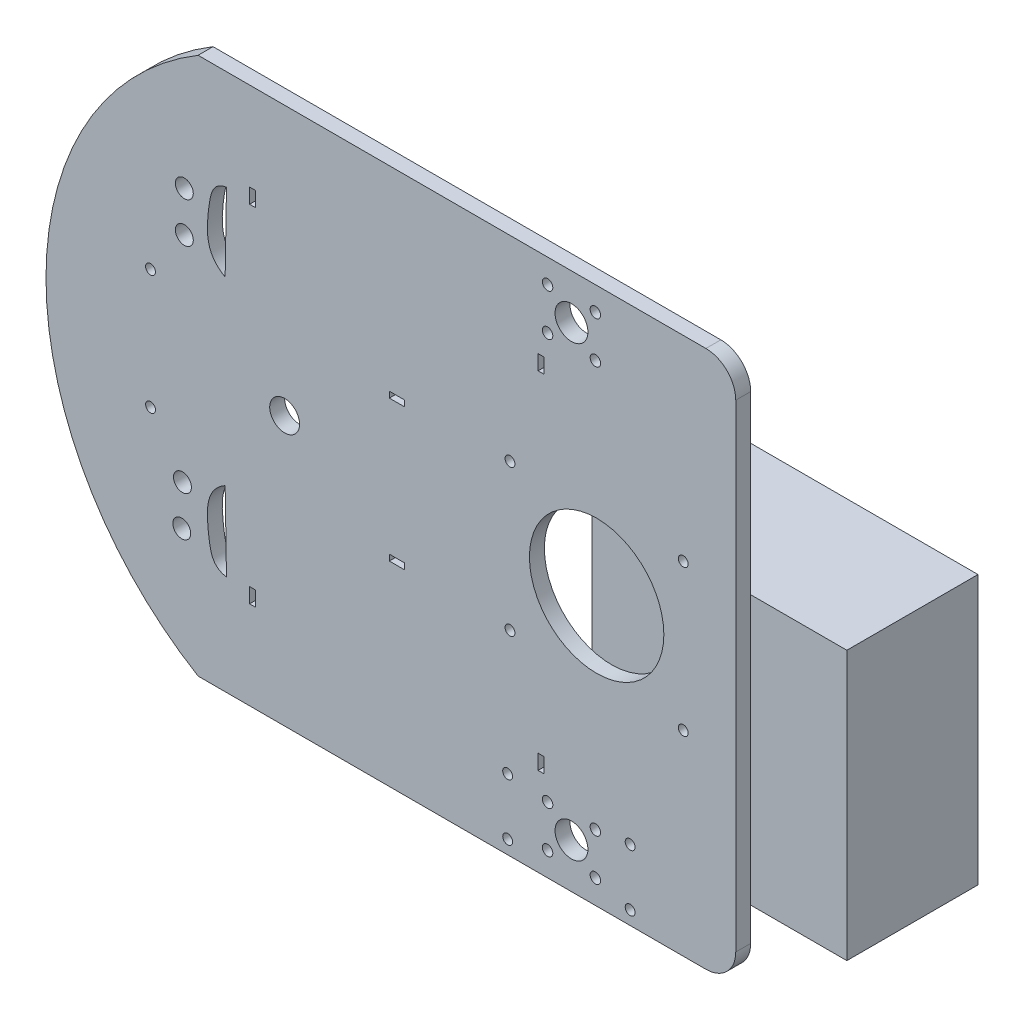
from build123d import *

# Parameters (mm, degrees)
EXTRUDE_1_DEPTH      = 5
SKETCH_6_R           = 1.65
CUT_EXTRUDE_2_DEPTH  = 293.826803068
SKETCH_7_R           = 1.75
SKETCH_7_R_2         = 5.5
CUT_EXTRUDE_3_DEPTH  = 10
SKETCH_11_R          = 1.65
CUT_EXTRUDE_4_DEPTH  = 293.826803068
SKETCH_17_W          = 2
SKETCH_17_H          = 5
CUT_EXTRUDE_9_DEPTH  = 293.826803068
SKETCH_20_W          = 2
SKETCH_20_H          = 5
CUT_EXTRUDE_10_DEPTH = 293.826803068
SKETCH_27_W          = 5
SKETCH_27_H          = 2
CUT_EXTRUDE_14_DEPTH = 293.826803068
SKETCH_29_W          = 85.279884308
SKETCH_29_H          = 43.905996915
EXTRUDE_2_DEPTH      = 90
SKETCH_32_R          = 3
CUT_EXTRUDE_15_DEPTH = 10
SKETCH_35_R          = 5
CUT_EXTRUDE_16_DEPTH = 10
CUT_EXTRUDE_17_DEPTH = 10
CUT_EXTRUDE_19_DEPTH = 10
SKETCH_40_R          = 1.65
CUT_EXTRUDE_20_DEPTH = 10


with BuildPart() as part:
    # Sketch 1 → Extrude 1 (new body)
    with BuildSketch(Plane.XY):
        with BuildLine():
            Line((-10, 0), (-180, 0))
            ThreePointArc((-180, 0), (-230.916730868, 90), (-180, 180))
            Line((-180, 180), (-10, 180))
            ThreePointArc((-10, 180), (-2.928932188, 177.071067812), (0, 170))
            Line((0, 170), (0, 10))
            ThreePointArc((0, 10), (-2.928932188, 2.928932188), (-10, 0))
        make_face()
    extrude(amount=EXTRUDE_1_DEPTH)

    # Sketch 6 → Cut-Extrude 2 (cut, through all)
    with BuildSketch(Plane.XY.offset(5)):
        with Locations((-195.916730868, 110)):
            Circle(SKETCH_6_R)
        with Locations(Location((-195.916730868, 70, 0), (0, 0, 180))):
            Circle(SKETCH_6_R)
    extrude(amount=-CUT_EXTRUDE_2_DEPTH, mode=Mode.SUBTRACT)

    # Sketch 7 → Cut-Extrude 3 (cut)
    with BuildSketch(Plane(origin=(0, 0, 0), x_dir=(-1, 0, 0), z_dir=(0, 0, -1))):
        with Locations((47.000000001, 157.999999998)):
            Circle(SKETCH_7_R)
        with Locations((46.999999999, 171.999999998)):
            Circle(SKETCH_7_R)
        with Locations((62.999999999, 172.000000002)):
            Circle(SKETCH_7_R)
        with Locations((63.000000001, 158.000000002)):
            Circle(SKETCH_7_R)
        with Locations((55, 165)):
            Circle(SKETCH_7_R_2)
        with Locations(Location((55, 15, 0), (0, 0, 180))):
            Circle(SKETCH_7_R_2)
        with Locations(Location((47.000000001, 22.000000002, 0), (0, 0, 180))):
            Circle(SKETCH_7_R)
        with Locations(Location((63.000000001, 21.999999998, 0), (0, 0, 180))):
            Circle(SKETCH_7_R)
        with Locations(Location((62.999999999, 7.999999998, 0), (0, 0, 180))):
            Circle(SKETCH_7_R)
        with Locations(Location((46.999999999, 8.000000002, 0), (0, 0, 180))):
            Circle(SKETCH_7_R)
    extrude(amount=-CUT_EXTRUDE_3_DEPTH, mode=Mode.SUBTRACT)

    # Sketch 11 → Cut-Extrude 4 (cut, through all)
    with BuildSketch(Plane.XY.offset(5)):
        with Locations((-75.573526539, 114.5018048)):
            Circle(SKETCH_11_R)
        with Locations((-17.573515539, 114.5018048)):
            Circle(SKETCH_11_R)
        with Locations((-17.573515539, 65.5052048)):
            Circle(SKETCH_11_R)
        with Locations((-75.573526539, 65.5052048)):
            Circle(SKETCH_11_R)
    extrude(amount=-CUT_EXTRUDE_4_DEPTH, mode=Mode.SUBTRACT)

    # Sketch 17 → Cut-Extrude 9 (cut, through all)
    with BuildSketch(Plane(origin=(0, 0, 0), x_dir=(-1, 0, 0), z_dir=(0, 0, -1))):
        with Locations((161.769673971, 147.921047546)):
            Rectangle(SKETCH_17_W, SKETCH_17_H)
        with Locations((65.169673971, 147.921047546)):
            Rectangle(SKETCH_17_W, SKETCH_17_H)
    extrude(amount=-CUT_EXTRUDE_9_DEPTH, mode=Mode.SUBTRACT)

    # Sketch 20 → Cut-Extrude 10 (cut, through all)
    with BuildSketch(Plane(origin=(0, 0, 0), x_dir=(-1, 0, 0), z_dir=(0, 0, -1))):
        with Locations((65.169673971, 147.921047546)):
            Rectangle(SKETCH_20_W, SKETCH_20_H)
        with Locations((161.769673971, 147.921047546)):
            Rectangle(SKETCH_20_W, SKETCH_20_H)
        with Locations((161.769673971, 32.078952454)):
            Rectangle(SKETCH_20_W, SKETCH_20_H)
        with Locations((65.169673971, 32.078952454)):
            Rectangle(SKETCH_20_W, SKETCH_20_H)
    extrude(amount=-CUT_EXTRUDE_10_DEPTH, mode=Mode.SUBTRACT)

    # Sketch 27 → Cut-Extrude 14 (cut, through all)
    with BuildSketch(Plane(origin=(0, 0, 0), x_dir=(-1, 0, 0), z_dir=(0, 0, -1))):
        with Locations((113.46967939, 113.622131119)):
            Rectangle(SKETCH_27_W, SKETCH_27_H)
        with Locations((113.46967939, 66.377868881)):
            Rectangle(SKETCH_27_W, SKETCH_27_H)
    extrude(amount=-CUT_EXTRUDE_14_DEPTH, mode=Mode.SUBTRACT)

    # Sketch 32 → Cut-Extrude 15 (cut)
    with BuildSketch(Plane.XY.offset(5)):
        with Locations((-184.607756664, 139.117368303)):
            Circle(SKETCH_32_R)
        with Locations((-184.607756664, 125.590830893)):
            Circle(SKETCH_32_R)
        with Locations((-185.235175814, 53.60736526)):
            Circle(SKETCH_32_R)
        with Locations((-185.470956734, 40.082882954)):
            Circle(SKETCH_32_R)
    extrude(amount=-CUT_EXTRUDE_15_DEPTH, mode=Mode.SUBTRACT)

    # Sketch 35 → Cut-Extrude 16 (cut)
    with BuildSketch(Plane.XY.offset(5)):
        with Locations((-151.026829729, 90)):
            Circle(SKETCH_35_R)
    extrude(amount=-CUT_EXTRUDE_16_DEPTH, mode=Mode.SUBTRACT)

    # Sketch 37 → Cut-Extrude 17 (cut)
    with BuildSketch(Plane(origin=(0, 0, 0), x_dir=(-1, 0, 0), z_dir=(0, 0, -1))):
        with BuildLine():
            ThreePointArc((63.761445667, 104.523327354), (46.573521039, 112.5035048), (29.385596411, 104.523327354))
            Line((29.385596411, 104.523327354), (46.573521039, 90.0035048))
            Line((46.573521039, 90.0035048), (63.761445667, 104.523327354))
        make_face()
        with BuildLine():
            Line((46.573521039, 90.0035048), (29.385596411, 104.523327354))
            ThreePointArc((29.385596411, 104.523327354), (24.073521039, 90.0035048), (29.385596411, 75.483682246))
            Line((29.385596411, 75.483682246), (46.573521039, 90.0035048))
        make_face()
        with BuildLine():
            Line((46.573521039, 90.0035048), (29.385596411, 75.483682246))
            ThreePointArc((29.385596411, 75.483682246), (46.573521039, 67.5035048), (63.761445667, 75.483682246))
            Line((63.761445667, 75.483682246), (46.573521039, 90.0035048))
        make_face()
        with BuildLine():
            ThreePointArc((69.073521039, 90.0035048), (67.703810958, 97.73401888), (63.761445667, 104.523327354))
            Line((63.761445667, 104.523327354), (46.573521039, 90.0035048))
            Line((46.573521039, 90.0035048), (63.761445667, 75.483682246))
            ThreePointArc((63.761445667, 75.483682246), (67.703810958, 82.27299072), (69.073521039, 90.0035048))
        make_face()
        with BuildLine():
            ThreePointArc((63.761445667, 104.523327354), (46.573521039, 112.5035048), (29.385596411, 104.523327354))
            Line((29.385596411, 104.523327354), (46.573521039, 90.0035048))
            Line((46.573521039, 90.0035048), (63.761445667, 104.523327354))
        make_face()
        with BuildLine():
            Line((46.573521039, 90.0035048), (29.385596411, 104.523327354))
            ThreePointArc((29.385596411, 104.523327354), (24.073521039, 90.0035048), (29.385596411, 75.483682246))
            Line((29.385596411, 75.483682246), (46.573521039, 90.0035048))
        make_face()
        with BuildLine():
            Line((46.573521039, 90.0035048), (29.385596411, 75.483682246))
            ThreePointArc((29.385596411, 75.483682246), (46.573521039, 67.5035048), (63.761445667, 75.483682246))
            Line((63.761445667, 75.483682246), (46.573521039, 90.0035048))
        make_face()
        with BuildLine():
            ThreePointArc((69.073521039, 90.0035048), (67.703810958, 97.73401888), (63.761445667, 104.523327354))
            Line((63.761445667, 104.523327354), (46.573521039, 90.0035048))
            Line((46.573521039, 90.0035048), (63.761445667, 75.483682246))
            ThreePointArc((63.761445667, 75.483682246), (67.703810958, 82.27299072), (69.073521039, 90.0035048))
        make_face()
        with BuildLine():
            ThreePointArc((63.761445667, 104.523327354), (46.573521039, 112.5035048), (29.385596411, 104.523327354))
            Line((29.385596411, 104.523327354), (46.573521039, 90.0035048))
            Line((46.573521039, 90.0035048), (63.761445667, 104.523327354))
        make_face()
        with BuildLine():
            Line((46.573521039, 90.0035048), (29.385596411, 104.523327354))
            ThreePointArc((29.385596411, 104.523327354), (24.073521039, 90.0035048), (29.385596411, 75.483682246))
            Line((29.385596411, 75.483682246), (46.573521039, 90.0035048))
        make_face()
        with BuildLine():
            Line((46.573521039, 90.0035048), (29.385596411, 75.483682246))
            ThreePointArc((29.385596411, 75.483682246), (46.573521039, 67.5035048), (63.761445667, 75.483682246))
            Line((63.761445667, 75.483682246), (46.573521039, 90.0035048))
        make_face()
        with BuildLine():
            ThreePointArc((69.073521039, 90.0035048), (67.703810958, 97.73401888), (63.761445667, 104.523327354))
            Line((63.761445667, 104.523327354), (46.573521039, 90.0035048))
            Line((46.573521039, 90.0035048), (63.761445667, 75.483682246))
            ThreePointArc((63.761445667, 75.483682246), (67.703810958, 82.27299072), (69.073521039, 90.0035048))
        make_face()
        with BuildLine():
            ThreePointArc((63.761445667, 104.523327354), (46.573521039, 112.5035048), (29.385596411, 104.523327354))
            Line((29.385596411, 104.523327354), (46.573521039, 90.0035048))
            Line((46.573521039, 90.0035048), (63.761445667, 104.523327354))
        make_face()
        with BuildLine():
            Line((46.573521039, 90.0035048), (29.385596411, 104.523327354))
            ThreePointArc((29.385596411, 104.523327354), (24.073521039, 90.0035048), (29.385596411, 75.483682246))
            Line((29.385596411, 75.483682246), (46.573521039, 90.0035048))
        make_face()
        with BuildLine():
            Line((46.573521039, 90.0035048), (29.385596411, 75.483682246))
            ThreePointArc((29.385596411, 75.483682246), (46.573521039, 67.5035048), (63.761445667, 75.483682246))
            Line((63.761445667, 75.483682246), (46.573521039, 90.0035048))
        make_face()
        with BuildLine():
            ThreePointArc((69.073521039, 90.0035048), (67.703810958, 97.73401888), (63.761445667, 104.523327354))
            Line((63.761445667, 104.523327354), (46.573521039, 90.0035048))
            Line((46.573521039, 90.0035048), (63.761445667, 75.483682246))
            ThreePointArc((63.761445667, 75.483682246), (67.703810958, 82.27299072), (69.073521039, 90.0035048))
        make_face()
    extrude(amount=-CUT_EXTRUDE_17_DEPTH, mode=Mode.SUBTRACT)

    # Sketch 39 → Cut-Extrude 19 (cut)
    with BuildSketch(Plane.XY.offset(5)):
        with BuildLine():
            add(Edge.make_bspline(
                [(-170.497148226, 33.50377418), (-175.138687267, 34.169197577), (-177.028420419, 44.925081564), (-177.86300712, 55.935344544), (-170.939704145, 59.76429454)],
                knots=[0.000272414, 0.000272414, 0.000272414, 0.000272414, 0.355909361, 1, 1, 1, 1], degree=3))
            Line((-170.497148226, 33.50377418), (-170.939704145, 59.76429454))
        make_face()
        with BuildLine():
            Line((-170.939704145, 120.23570546), (-170.497148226, 146.49622582))
            add(Edge.make_bspline(
                [(-170.497148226, 146.49622582), (-175.138687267, 145.830802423), (-177.028420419, 135.074918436), (-177.86300712, 124.064655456), (-170.939704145, 120.23570546)],
                knots=[0.000272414, 0.000272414, 0.000272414, 0.000272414, 0.355909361, 1, 1, 1, 1], degree=3))
        make_face()
    extrude(amount=-CUT_EXTRUDE_19_DEPTH, mode=Mode.SUBTRACT)

    # Sketch 40 → Cut-Extrude 20 (cut)
    with BuildSketch(Plane.XY.offset(5)):
        with Locations((-76.370105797, 23.521610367)):
            Circle(SKETCH_40_R)
        with Locations((-35.359945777, 23.520594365)):
            Circle(SKETCH_40_R)
        with Locations((-76.359945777, 4.551582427)):
            Circle(SKETCH_40_R)
        with Locations((-35.359945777, 4.551582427)):
            Circle(SKETCH_40_R)
    extrude(amount=-CUT_EXTRUDE_20_DEPTH, mode=Mode.SUBTRACT)


with BuildPart() as body_2:
    # Sketch 29 → Extrude 2 (new body)
    with BuildSketch(Plane(origin=(0, 0, 0), x_dir=(1, 0, 0), z_dir=(0, 1, 0))):
        with Locations((-31.549664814, 43.054599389)):
            Rectangle(SKETCH_29_W, SKETCH_29_H)
    extrude(amount=EXTRUDE_2_DEPTH)


solid = Compound([part.part, body_2.part])
